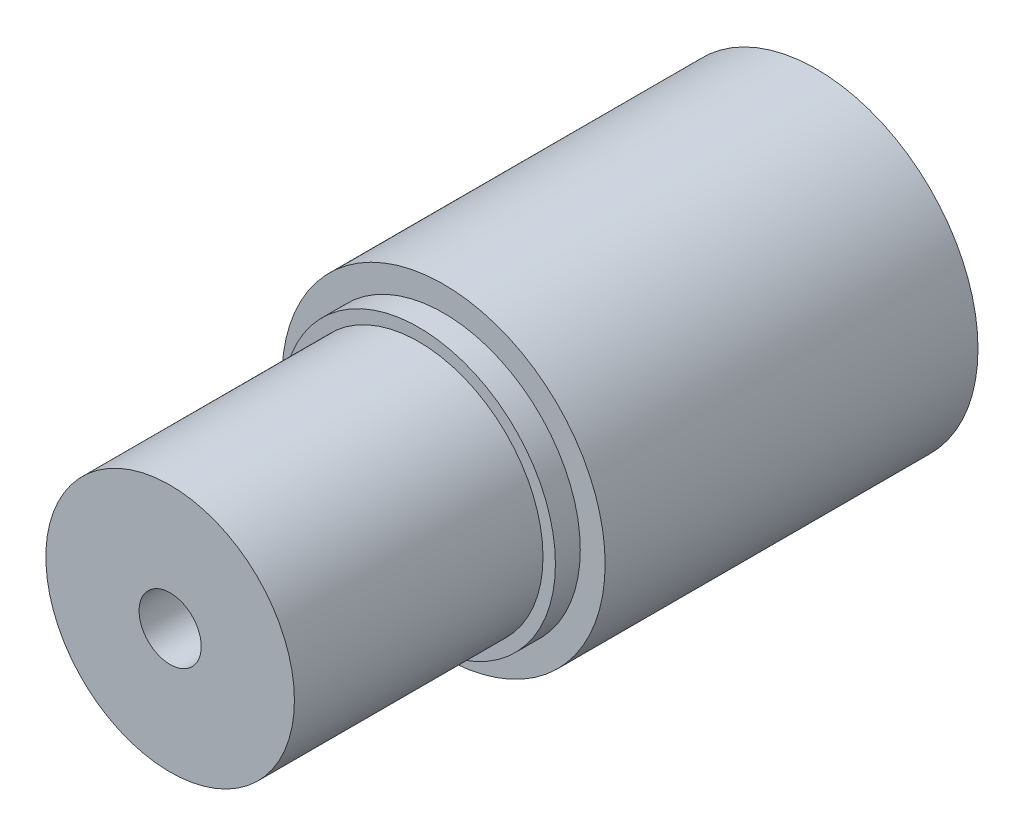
from build123d import *

# Parameters (mm, degrees)
ESQUISSE1_R                           = 13
EXTRUSION1_DEPTH                      = 30
DIAM_TRE_DU_PER_AGE_14_5_14_5_1_D     = 14.5
DIAM_TRE_DU_PER_AGE_14_5_14_5_1_DEPTH = 12
DIAM_TRE_DU_PER_AGE_14_5_14_5_1_TIP   = 4.356239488
TROU_TARAUD_M61_D                     = 5


with BuildPart() as part:
    # Esquisse1 → Extrusion1 (new body)
    with BuildSketch(Plane.XY):
        Circle(ESQUISSE1_R)
    extrude(amount=EXTRUSION1_DEPTH)

    # Esquisse3 → R_volution1 (revolve)
    with BuildSketch(Plane(origin=(0, 0, 0), x_dir=(0, 0, -1), z_dir=(1, 0, 0)), mode=Mode.PRIVATE) as r_volution1_sk:
        Polygon((-30, 11), (-32, 11), (-32, 10), (-52, 10), (-52, 0), (-30, 0), align=None)
    revolve(r_volution1_sk.sketch.rotate(Axis((0, 0, 52), (0, 0, -1)), 90), axis=Axis((0, 0, 52), (0, 0, -1)))

    # Diam_tre du per_age _14.5 _14.5_1
    with Locations(Plane(origin=(0, 0, 0), x_dir=(-1, 0, 0), z_dir=(0, 0, -1))):
        with Locations((0, 0)):
            Hole(DIAM_TRE_DU_PER_AGE_14_5_14_5_1_D / 2, depth=DIAM_TRE_DU_PER_AGE_14_5_14_5_1_DEPTH)
            with Locations((0, 0, -(DIAM_TRE_DU_PER_AGE_14_5_14_5_1_DEPTH + DIAM_TRE_DU_PER_AGE_14_5_14_5_1_TIP / 2))):  # 118° drill point
                Cone(0, DIAM_TRE_DU_PER_AGE_14_5_14_5_1_D / 2, DIAM_TRE_DU_PER_AGE_14_5_14_5_1_TIP, mode=Mode.SUBTRACT)

    # Trou taraud_ M61 (through all)
    with Locations(Plane.XY.offset(52)):
        with Locations((0, 0)):
            Hole(TROU_TARAUD_M61_D / 2)


solid = part.part
